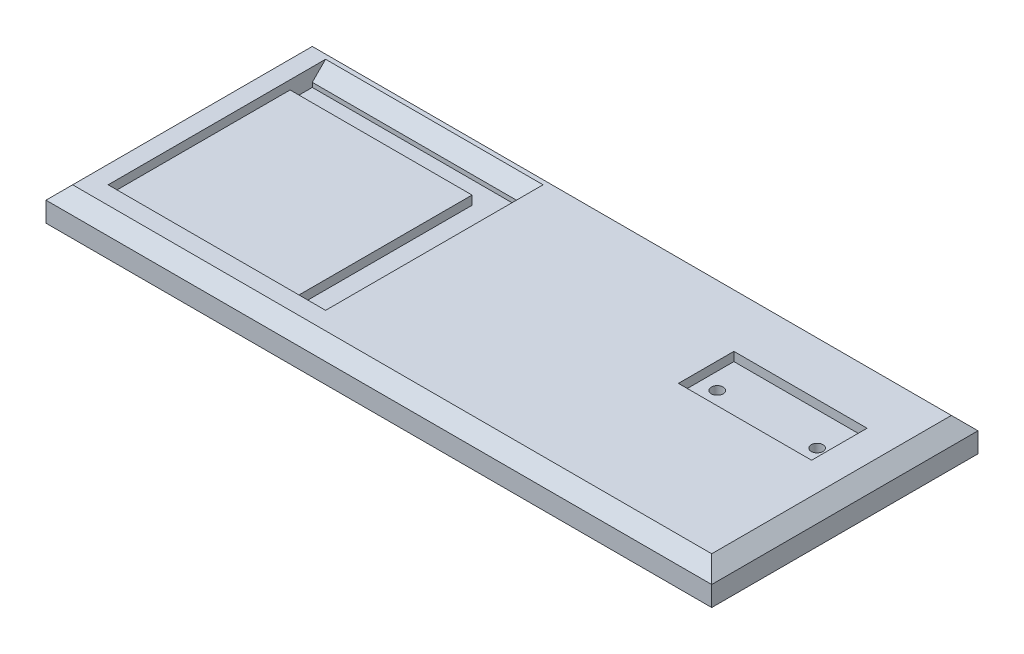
from build123d import *

# Parameters (mm, degrees)
SKETCH1_W                                            = 381
SKETCH1_H                                            = 152.4
SKETCH1_W_2                                          = 116.84
SKETCH1_H_2                                          = 116.84
SKETCH1_W_3                                          = 76.2
SKETCH1_H_3                                          = 31.75
SKETCH1_W_4                                          = 104.14
SKETCH1_H_4                                          = 104.14
BASE_EXTRUDE_DEPTH                                   = 19.05
SKETCH1_3_W                                          = 104.14
SKETCH1_3_H                                          = 104.14
SKETCH1_3_W_2                                        = 76.2
SKETCH1_3_H_2                                        = 31.75
DEVICE_CUT_DEPTH                                     = 5.08
HINGE_CUT_DEPTH                                      = 5.08
CBORE_FOR_1_4_BINDING_HEAD_MACHINE_SCREW_D           = 6.7564
CBORE_FOR_1_4_BINDING_HEAD_MACHINE_SCREW_CBORE_D     = 14.2875
CBORE_FOR_1_4_BINDING_HEAD_MACHINE_SCREW_CBORE_DEPTH = 6.731
SIDE_CHAMFER_SIZE                                    = 7.62


with BuildPart() as part:
    # Sketch1 → Base Extrude (new body)
    # profile 1 of 4: a face of its own
    with BuildSketch(Plane(origin=(0, 0, 0), x_dir=(1, 0, 0), z_dir=(0, 1, 0))):
        Rectangle(SKETCH1_W, SKETCH1_H)
        with Locations((-114.3, 0)):
            Rectangle(SKETCH1_W_2, SKETCH1_H_2, mode=Mode.SUBTRACT)
        with Locations((127, 22.225)):
            Rectangle(SKETCH1_W_3, SKETCH1_H_3, mode=Mode.SUBTRACT)
    # profile 2 of 4: a face of its own
    with BuildSketch(Plane(origin=(0, 0, 0), x_dir=(1, 0, 0), z_dir=(0, 1, 0))):
        with Locations((-120.65, -6.35)):
            Rectangle(SKETCH1_W_4, SKETCH1_H_4)
    # profile 3 of 4: a face of its own
    with BuildSketch(Plane(origin=(0, 0, 0), x_dir=(1, 0, 0), z_dir=(0, 1, 0))):
        Polygon((-55.88, -58.42), (-55.88, 58.42), (-172.72, 58.42), (-172.72, 45.72), (-68.58, 45.72), (-68.58, -58.42), align=None)
    # profile 4 of 4: a face of its own
    with BuildSketch(Plane(origin=(0, 0, 0), x_dir=(1, 0, 0), z_dir=(0, 1, 0))):
        with Locations((127, 22.225)):
            Rectangle(SKETCH1_W_3, SKETCH1_H_3)
    extrude(amount=-BASE_EXTRUDE_DEPTH)

    # Sketch1_3 → Device Cut (cut)
    with BuildSketch(Plane(origin=(0, 0, 0), x_dir=(1, 0, 0), z_dir=(0, 1, 0))):
        with Locations((-120.65, -6.35)):
            Rectangle(SKETCH1_3_W, SKETCH1_3_H)
        Polygon((-55.88, -58.42), (-55.88, 58.42), (-172.72, 58.42), (-172.72, 45.72), (-68.58, 45.72), (-68.58, -58.42), align=None)
        with Locations((127, 22.225)):
            Rectangle(SKETCH1_3_W_2, SKETCH1_3_H_2)
    extrude(amount=-DEVICE_CUT_DEPTH, mode=Mode.SUBTRACT)

    # Sketch2 → Hinge Cut (cut)
    with BuildSketch(Plane(origin=(0, -5.08, 0), x_dir=(1, 0, 0), z_dir=(0, 1, 0))):
        Polygon((-68.58, 45.72), (-172.72, 45.72), (-172.72, 58.42), (-55.88, 58.42), (-55.88, -58.42), (-68.58, -58.42), align=None)
    extrude(amount=-HINGE_CUT_DEPTH, mode=Mode.SUBTRACT)

    # CBORE for 1_4 Binding Head Machine Screw (through all)
    with Locations(Plane.XZ.offset(19.05)):
        with Locations((155.575, -19.05), (98.425, -19.05)):
            CounterBoreHole(CBORE_FOR_1_4_BINDING_HEAD_MACHINE_SCREW_D / 2, CBORE_FOR_1_4_BINDING_HEAD_MACHINE_SCREW_CBORE_D / 2, CBORE_FOR_1_4_BINDING_HEAD_MACHINE_SCREW_CBORE_DEPTH)

    # Side Chamfer
    side_chamfer_edges = [part.edges().sort_by_distance(p)[0] for p in [
        (-55.88, 0, 0),
        (-114.3, 0, -58.42),
        (190.5, 0, 0),
        (0, 0, 76.2),
        (-190.5, 0, 0),
        (0, 0, -76.2),
    ]]
    chamfer(side_chamfer_edges, length=SIDE_CHAMFER_SIZE)


solid = part.part
